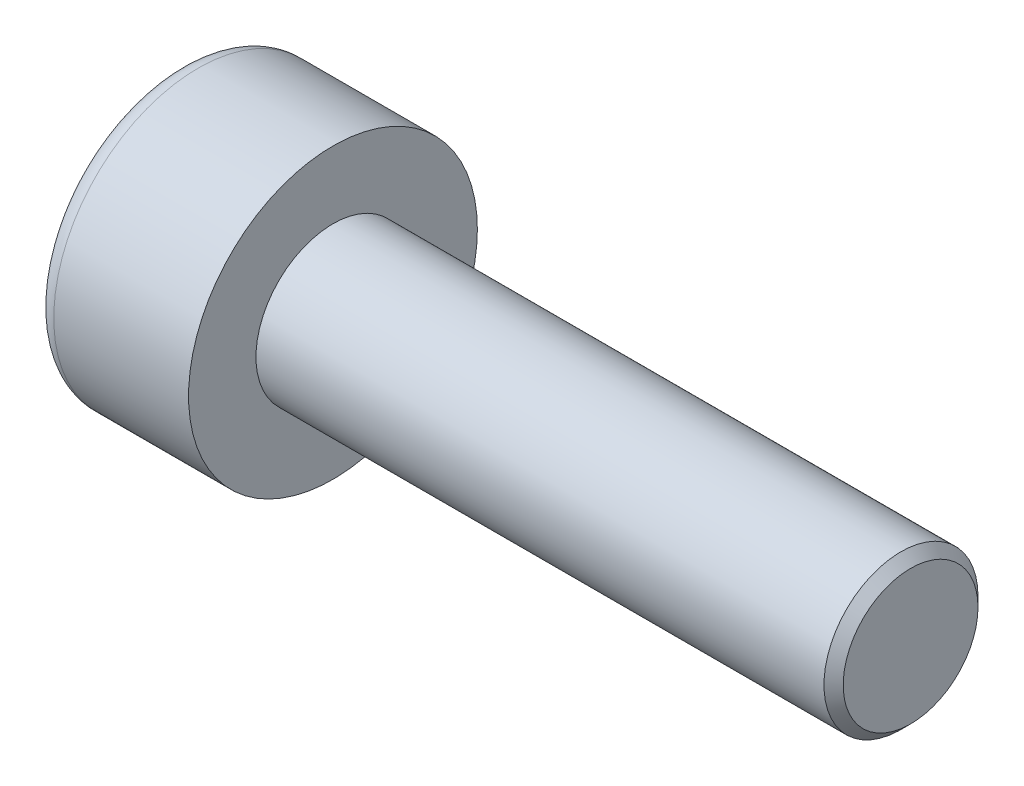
from build123d import *

# Parameters (mm, degrees)
SKETCH1_R           = 1.5
BASEHEAD_DEPTH      = 1.6
SKETCH2_R           = 0.8
BASEBODY_DEPTH      = 6
HEXAGONSOCKET_DEPTH = 0.7
TOPFILLET_R         = 0.2
CHAMFER1_SIZE       = 0.1


with BuildPart() as part:
    # Sketch1 → BaseHead (new body)
    with BuildSketch(Plane(origin=(0, 0, 0), x_dir=(0, 0, -1), z_dir=(1, 0, 0))):
        Circle(SKETCH1_R)
    extrude(amount=BASEHEAD_DEPTH)

    # Sketch2 → BaseBody (add)
    with BuildSketch(Plane(origin=(1.6, 0, 0), x_dir=(0, 0, -1), z_dir=(1, 0, 0))):
        Circle(SKETCH2_R)
    extrude(amount=BASEBODY_DEPTH)

    # Sketch3 → HexagonSocket (cut)
    with BuildSketch(Plane(origin=(0, 0, 0), x_dir=(0, 0, -1), z_dir=(1, 0, 0))):
        Polygon((0.866025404, 0), (0.433012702, 0.75), (-0.433012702, 0.75), (-0.866025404, 0), (-0.433012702, -0.75), (0.433012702, -0.75), align=None)
    extrude(amount=HEXAGONSOCKET_DEPTH, mode=Mode.SUBTRACT)

    # Sketch4 → Cut-Revolve1 (revolve, cut)
    with BuildSketch(Plane(origin=(-4.19613823, 0.75, 0), x_dir=(-1, 0, 0), z_dir=(0, 0, 1)), mode=Mode.PRIVATE) as cut_revolve1_sk:
        Polygon((-4.89613823, 1.5), (-5.329150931, 0.75), (-4.89613823, 0.75), align=None)
    revolve(cut_revolve1_sk.sketch.rotate(Axis((0.838992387, 0, 0), (-1, 0, 0)), 90), axis=Axis((0.838992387, 0, 0), (-1, 0, 0)), mode=Mode.SUBTRACT)

    # TopFillet
    topfillet_edges = [part.edges().sort_by_distance(p)[0] for p in [
        (0, 0, 1.5),
    ]]
    fillet(topfillet_edges, radius=TOPFILLET_R)

    # Chamfer1
    chamfer1_edges = [part.edges().sort_by_distance(p)[0] for p in [
        (7.6, 0, 0.8),
    ]]
    chamfer(chamfer1_edges, length=CHAMFER1_SIZE)


solid = part.part
